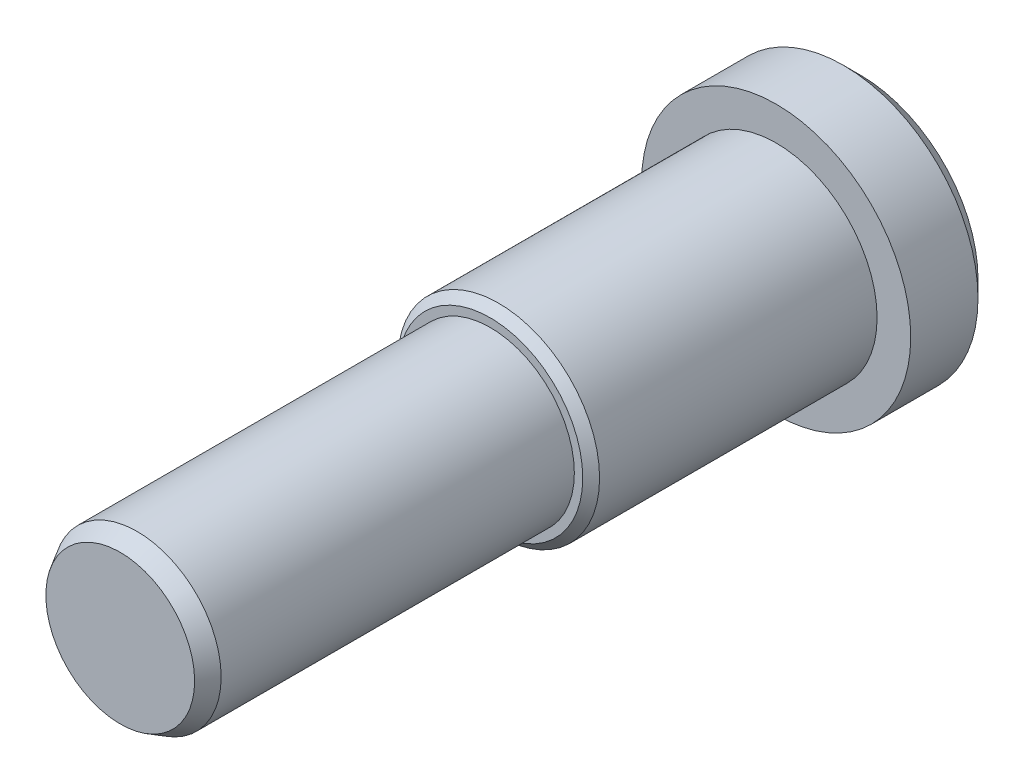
ISO-10303-21;
HEADER;
FILE_DESCRIPTION(('STEP AP214'),'2;1');
FILE_NAME('part.step','',(''),(''),'','','');
FILE_SCHEMA(('AUTOMOTIVE_DESIGN { 1 0 10303 214 1 1 1 1 }'));
ENDSEC;
DATA;
#1=APPLICATION_CONTEXT('core data for automotive mechanical design processes');
#2=APPLICATION_PROTOCOL_DEFINITION('international standard','automotive_design',2000,#1);
#3=PRODUCT_CONTEXT('',#1,'mechanical');
#4=PRODUCT('Part','Part','',(#3));
#5=PRODUCT_RELATED_PRODUCT_CATEGORY('part','',(#4));
#6=PRODUCT_DEFINITION_FORMATION('','',#4);
#7=PRODUCT_DEFINITION_CONTEXT('part definition',#1,'design');
#8=PRODUCT_DEFINITION('design','',#6,#7);
#9=PRODUCT_DEFINITION_SHAPE('','',#8);
#10=(LENGTH_UNIT() NAMED_UNIT(*) SI_UNIT(.MILLI.,.METRE.));
#11=(NAMED_UNIT(*) PLANE_ANGLE_UNIT() SI_UNIT($,.RADIAN.));
#12=(NAMED_UNIT(*) SI_UNIT($,.STERADIAN.) SOLID_ANGLE_UNIT());
#13=UNCERTAINTY_MEASURE_WITH_UNIT(LENGTH_MEASURE(1.E-05),#10,'distance_accuracy_value','');
#14=(GEOMETRIC_REPRESENTATION_CONTEXT(3) GLOBAL_UNCERTAINTY_ASSIGNED_CONTEXT((#13)) GLOBAL_UNIT_ASSIGNED_CONTEXT((#10,
#11,#12)) REPRESENTATION_CONTEXT('',''));
#15=CARTESIAN_POINT('',(0.,0.,0.));
#16=DIRECTION('',(0.,0.,1.));
#17=DIRECTION('',(1.,0.,0.));
#18=AXIS2_PLACEMENT_3D('',#15,#16,#17);
#19=CARTESIAN_POINT('',(0.,0.,-5.));
#20=DIRECTION('',(0.,0.,1.));
#21=DIRECTION('',(1.,0.,0.));
#22=AXIS2_PLACEMENT_3D('',#19,#20,#21);
#23=CYLINDRICAL_SURFACE('',#22,8.);
#24=CARTESIAN_POINT('',(0.,0.,-4.));
#25=DIRECTION('',(0.,0.,1.));
#26=DIRECTION('',(1.,0.,0.));
#27=AXIS2_PLACEMENT_3D('',#24,#25,#26);
#28=CIRCLE('',#27,8.);
#29=CARTESIAN_POINT('',(8.,0.,-4.));
#30=VERTEX_POINT('',#29);
#31=EDGE_CURVE('E53',#30,#30,#28,.T.);
#32=ORIENTED_EDGE('',*,*,#31,.T.);
#33=EDGE_LOOP('',(#32));
#34=FACE_BOUND('',#33,.T.);
#35=CARTESIAN_POINT('',(0.,0.,0.));
#36=DIRECTION('',(0.,0.,1.));
#37=DIRECTION('',(1.,0.,0.));
#38=AXIS2_PLACEMENT_3D('',#35,#36,#37);
#39=CIRCLE('',#38,8.);
#40=CARTESIAN_POINT('',(8.,0.,0.));
#41=VERTEX_POINT('',#40);
#42=EDGE_CURVE('E56',#41,#41,#39,.T.);
#43=ORIENTED_EDGE('',*,*,#42,.F.);
#44=EDGE_LOOP('',(#43));
#45=FACE_BOUND('',#44,.T.);
#46=ADVANCED_FACE('F30',(#34,#45),#23,.T.);
#47=CARTESIAN_POINT('',(0.,0.,-5.));
#48=DIRECTION('',(0.,0.,1.));
#49=DIRECTION('',(1.,0.,0.));
#50=AXIS2_PLACEMENT_3D('',#47,#48,#49);
#51=PLANE('',#50);
#52=CARTESIAN_POINT('',(0.,0.,-5.));
#53=DIRECTION('',(0.,0.,1.));
#54=DIRECTION('',(1.,0.,0.));
#55=AXIS2_PLACEMENT_3D('',#52,#53,#54);
#56=CIRCLE('',#55,7.);
#57=CARTESIAN_POINT('',(7.,0.,-5.));
#58=VERTEX_POINT('',#57);
#59=EDGE_CURVE('E50',#58,#58,#56,.F.);
#60=ORIENTED_EDGE('',*,*,#59,.T.);
#61=EDGE_LOOP('',(#60));
#62=FACE_BOUND('',#61,.T.);
#63=ADVANCED_FACE('F82',(#62),#51,.F.);
#64=CARTESIAN_POINT('',(0.,0.,0.));
#65=DIRECTION('',(0.,0.,1.));
#66=DIRECTION('',(1.,0.,0.));
#67=AXIS2_PLACEMENT_3D('',#64,#65,#66);
#68=PLANE('',#67);
#69=CARTESIAN_POINT('',(0.,0.,0.));
#70=DIRECTION('',(0.,0.,1.));
#71=DIRECTION('',(1.,0.,0.));
#72=AXIS2_PLACEMENT_3D('',#69,#70,#71);
#73=CIRCLE('',#72,6.);
#74=CARTESIAN_POINT('',(6.,0.,0.));
#75=VERTEX_POINT('',#74);
#76=EDGE_CURVE('E59',#75,#75,#73,.T.);
#77=ORIENTED_EDGE('',*,*,#76,.F.);
#78=EDGE_LOOP('',(#77));
#79=FACE_BOUND('',#78,.T.);
#80=ORIENTED_EDGE('',*,*,#42,.T.);
#81=EDGE_LOOP('',(#80));
#82=FACE_BOUND('',#81,.T.);
#83=ADVANCED_FACE('F88',(#79,#82),#68,.T.);
#84=CARTESIAN_POINT('',(0.,0.,-4.));
#85=DIRECTION('',(0.,0.,1.));
#86=DIRECTION('',(1.,0.,0.));
#87=AXIS2_PLACEMENT_3D('',#84,#85,#86);
#88=CONICAL_SURFACE('',#87,8.,0.78539816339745);
#89=ORIENTED_EDGE('',*,*,#59,.F.);
#90=EDGE_LOOP('',(#89));
#91=FACE_BOUND('',#90,.T.);
#92=ORIENTED_EDGE('',*,*,#31,.F.);
#93=EDGE_LOOP('',(#92));
#94=FACE_BOUND('',#93,.T.);
#95=ADVANCED_FACE('F79',(#91,#94),#88,.T.);
#96=CARTESIAN_POINT('',(0.,0.,17.));
#97=DIRECTION('',(0.,0.,-1.));
#98=DIRECTION('',(-1.,0.,0.));
#99=AXIS2_PLACEMENT_3D('',#96,#97,#98);
#100=CYLINDRICAL_SURFACE('',#99,6.);
#101=CARTESIAN_POINT('',(0.,0.,16.5));
#102=DIRECTION('',(0.,0.,1.));
#103=DIRECTION('',(1.,0.,0.));
#104=AXIS2_PLACEMENT_3D('',#101,#102,#103);
#105=CIRCLE('',#104,6.);
#106=CARTESIAN_POINT('',(6.,0.,16.5));
#107=VERTEX_POINT('',#106);
#108=EDGE_CURVE('E10',#107,#107,#105,.F.);
#109=ORIENTED_EDGE('',*,*,#108,.T.);
#110=EDGE_LOOP('',(#109));
#111=FACE_BOUND('',#110,.T.);
#112=ORIENTED_EDGE('',*,*,#76,.T.);
#113=EDGE_LOOP('',(#112));
#114=FACE_BOUND('',#113,.T.);
#115=ADVANCED_FACE('F70',(#111,#114),#100,.T.);
#116=CARTESIAN_POINT('',(0.,0.,17.));
#117=DIRECTION('',(0.,0.,1.));
#118=DIRECTION('',(1.,0.,0.));
#119=AXIS2_PLACEMENT_3D('',#116,#117,#118);
#120=PLANE('',#119);
#121=CARTESIAN_POINT('',(0.,0.,17.));
#122=DIRECTION('',(0.,0.,1.));
#123=DIRECTION('',(1.,0.,0.));
#124=AXIS2_PLACEMENT_3D('',#121,#122,#123);
#125=CIRCLE('',#124,5.5);
#126=CARTESIAN_POINT('',(5.5,0.,17.));
#127=VERTEX_POINT('',#126);
#128=EDGE_CURVE('E37',#127,#127,#125,.T.);
#129=ORIENTED_EDGE('',*,*,#128,.T.);
#130=EDGE_LOOP('',(#129));
#131=FACE_BOUND('',#130,.T.);
#132=CARTESIAN_POINT('',(0.,0.,17.));
#133=DIRECTION('',(0.,0.,1.));
#134=DIRECTION('',(1.,0.,0.));
#135=AXIS2_PLACEMENT_3D('',#132,#133,#134);
#136=CIRCLE('',#135,5.);
#137=CARTESIAN_POINT('',(5.,0.,17.));
#138=VERTEX_POINT('',#137);
#139=EDGE_CURVE('E62',#138,#138,#136,.T.);
#140=ORIENTED_EDGE('',*,*,#139,.F.);
#141=EDGE_LOOP('',(#140));
#142=FACE_BOUND('',#141,.T.);
#143=ADVANCED_FACE('F68',(#131,#142),#120,.T.);
#144=CARTESIAN_POINT('',(0.,0.,39.));
#145=DIRECTION('',(0.,0.,-1.));
#146=DIRECTION('',(-1.,0.,0.));
#147=AXIS2_PLACEMENT_3D('',#144,#145,#146);
#148=CYLINDRICAL_SURFACE('',#147,5.);
#149=CARTESIAN_POINT('',(0.,0.,38.));
#150=DIRECTION('',(0.,0.,1.));
#151=DIRECTION('',(1.,0.,0.));
#152=AXIS2_PLACEMENT_3D('',#149,#150,#151);
#153=CIRCLE('',#152,5.);
#154=CARTESIAN_POINT('',(5.,0.,38.));
#155=VERTEX_POINT('',#154);
#156=EDGE_CURVE('E41',#155,#155,#153,.F.);
#157=ORIENTED_EDGE('',*,*,#156,.T.);
#158=EDGE_LOOP('',(#157));
#159=FACE_BOUND('',#158,.T.);
#160=ORIENTED_EDGE('',*,*,#139,.T.);
#161=EDGE_LOOP('',(#160));
#162=FACE_BOUND('',#161,.T.);
#163=ADVANCED_FACE('F66',(#159,#162),#148,.T.);
#164=CARTESIAN_POINT('',(0.,0.,39.));
#165=DIRECTION('',(0.,0.,1.));
#166=DIRECTION('',(1.,0.,0.));
#167=AXIS2_PLACEMENT_3D('',#164,#165,#166);
#168=PLANE('',#167);
#169=CARTESIAN_POINT('',(0.,0.,39.));
#170=DIRECTION('',(0.,0.,1.));
#171=DIRECTION('',(1.,0.,0.));
#172=AXIS2_PLACEMENT_3D('',#169,#170,#171);
#173=CIRCLE('',#172,4.42264973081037);
#174=CARTESIAN_POINT('',(4.42264973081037,0.,39.));
#175=VERTEX_POINT('',#174);
#176=EDGE_CURVE('E45',#175,#175,#173,.T.);
#177=ORIENTED_EDGE('',*,*,#176,.T.);
#178=EDGE_LOOP('',(#177));
#179=FACE_BOUND('',#178,.T.);
#180=ADVANCED_FACE('F76',(#179),#168,.T.);
#181=CARTESIAN_POINT('',(0.,0.,39.));
#182=DIRECTION('',(0.,0.,-1.));
#183=DIRECTION('',(-1.,0.,0.));
#184=AXIS2_PLACEMENT_3D('',#181,#182,#183);
#185=CONICAL_SURFACE('',#184,4.42264973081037,0.523598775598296);
#186=ORIENTED_EDGE('',*,*,#156,.F.);
#187=EDGE_LOOP('',(#186));
#188=FACE_BOUND('',#187,.T.);
#189=ORIENTED_EDGE('',*,*,#176,.F.);
#190=EDGE_LOOP('',(#189));
#191=FACE_BOUND('',#190,.T.);
#192=ADVANCED_FACE('F96',(#188,#191),#185,.T.);
#193=CARTESIAN_POINT('',(0.,0.,17.));
#194=DIRECTION('',(0.,0.,-1.));
#195=DIRECTION('',(-1.,0.,0.));
#196=AXIS2_PLACEMENT_3D('',#193,#194,#195);
#197=CONICAL_SURFACE('',#196,5.5,0.785398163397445);
#198=ORIENTED_EDGE('',*,*,#108,.F.);
#199=EDGE_LOOP('',(#198));
#200=FACE_BOUND('',#199,.T.);
#201=ORIENTED_EDGE('',*,*,#128,.F.);
#202=EDGE_LOOP('',(#201));
#203=FACE_BOUND('',#202,.T.);
#204=ADVANCED_FACE('F32',(#200,#203),#197,.T.);
#205=CLOSED_SHELL('',(#46,#63,#83,#95,#115,#143,#163,#180,#192,#204));
#206=MANIFOLD_SOLID_BREP('B2',#205);
#207=ADVANCED_BREP_SHAPE_REPRESENTATION('',(#18,#206),#14);
#208=SHAPE_DEFINITION_REPRESENTATION(#9,#207);
ENDSEC;
END-ISO-10303-21;
